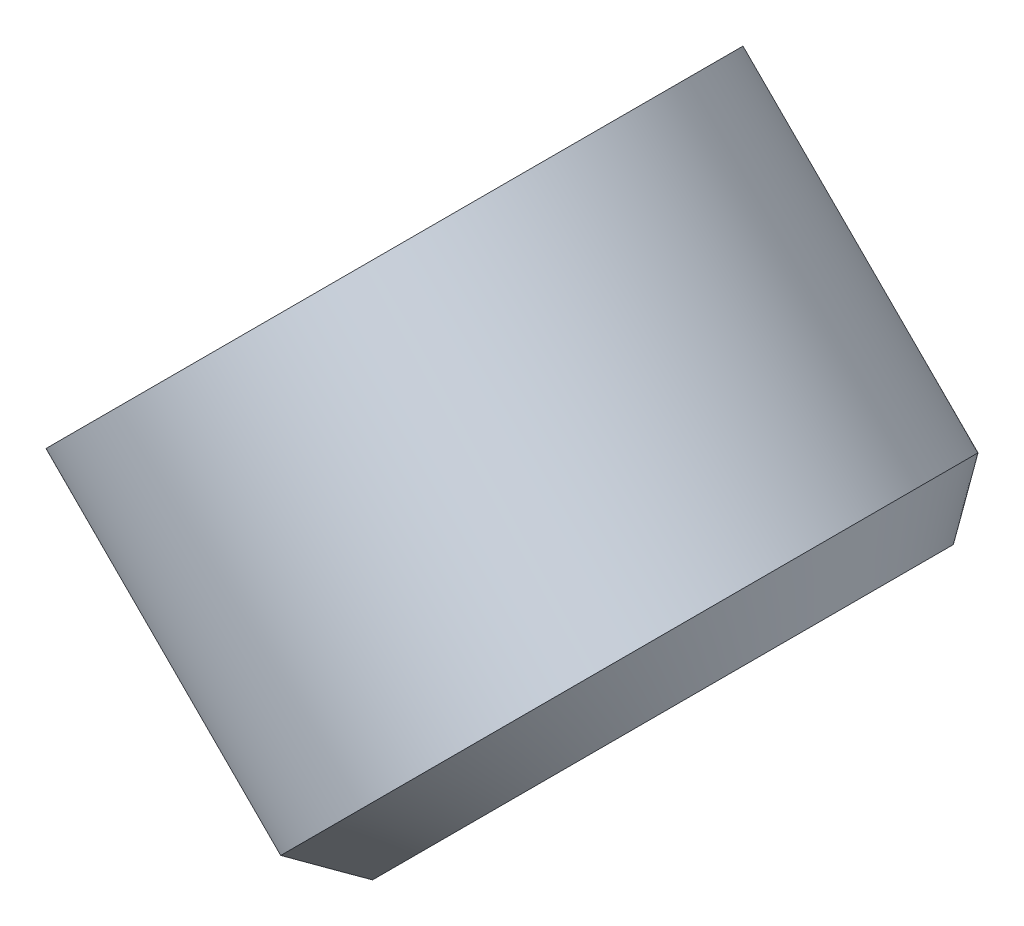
ISO-10303-21;
HEADER;
FILE_DESCRIPTION(('STEP AP214'),'2;1');
FILE_NAME('part.step','',(''),(''),'','','');
FILE_SCHEMA(('AUTOMOTIVE_DESIGN { 1 0 10303 214 1 1 1 1 }'));
ENDSEC;
DATA;
#1=APPLICATION_CONTEXT('core data for automotive mechanical design processes');
#2=APPLICATION_PROTOCOL_DEFINITION('international standard','automotive_design',2000,#1);
#3=PRODUCT_CONTEXT('',#1,'mechanical');
#4=PRODUCT('Part','Part','',(#3));
#5=PRODUCT_RELATED_PRODUCT_CATEGORY('part','',(#4));
#6=PRODUCT_DEFINITION_FORMATION('','',#4);
#7=PRODUCT_DEFINITION_CONTEXT('part definition',#1,'design');
#8=PRODUCT_DEFINITION('design','',#6,#7);
#9=PRODUCT_DEFINITION_SHAPE('','',#8);
#10=(LENGTH_UNIT() NAMED_UNIT(*) SI_UNIT(.MILLI.,.METRE.));
#11=(NAMED_UNIT(*) PLANE_ANGLE_UNIT() SI_UNIT($,.RADIAN.));
#12=(NAMED_UNIT(*) SI_UNIT($,.STERADIAN.) SOLID_ANGLE_UNIT());
#13=UNCERTAINTY_MEASURE_WITH_UNIT(LENGTH_MEASURE(1.E-05),#10,'distance_accuracy_value','');
#14=(GEOMETRIC_REPRESENTATION_CONTEXT(3) GLOBAL_UNCERTAINTY_ASSIGNED_CONTEXT((#13)) GLOBAL_UNIT_ASSIGNED_CONTEXT((#10,
#11,#12)) REPRESENTATION_CONTEXT('',''));
#15=CARTESIAN_POINT('',(0.,0.,0.));
#16=DIRECTION('',(0.,0.,1.));
#17=DIRECTION('',(1.,0.,0.));
#18=AXIS2_PLACEMENT_3D('',#15,#16,#17);
#19=CARTESIAN_POINT('',(-5.00539085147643,7.39387099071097,43.18));
#20=DIRECTION('',(-0.707106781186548,0.707106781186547,0.));
#21=DIRECTION('',(0.,0.,-1.));
#22=AXIS2_PLACEMENT_3D('',#19,#20,#21);
#23=PLANE('',#22);
#24=CARTESIAN_POINT('',(-6.1996309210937,6.19963092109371,41.656));
#25=DIRECTION('',(-0.707106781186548,0.707106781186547,0.));
#26=DIRECTION('',(-0.707106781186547,-0.707106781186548,0.));
#27=AXIS2_PLACEMENT_3D('',#24,#25,#26);
#28=CIRCLE('',#27,1.52399999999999);
#29=CARTESIAN_POINT('',(-7.27726165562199,5.12200018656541,41.656));
#30=VERTEX_POINT('',#29);
#31=EDGE_CURVE('E27',#30,#30,#28,.F.);
#32=ORIENTED_EDGE('',*,*,#31,.F.);
#33=EDGE_LOOP('',(#32));
#34=FACE_BOUND('',#33,.T.);
#35=ADVANCED_FACE('F15',(#34),#23,.T.);
#36=CARTESIAN_POINT('',(-3.8647643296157,5.66081555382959,40.386));
#37=DIRECTION('',(0.707106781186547,-0.707106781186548,0.));
#38=DIRECTION('',(0.,0.,1.));
#39=AXIS2_PLACEMENT_3D('',#36,#37,#38);
#40=PLANE('',#39);
#41=CARTESIAN_POINT('',(-4.76278994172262,4.76278994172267,41.656));
#42=DIRECTION('',(0.707106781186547,-0.707106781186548,0.));
#43=DIRECTION('',(0.707106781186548,0.707106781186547,0.));
#44=AXIS2_PLACEMENT_3D('',#41,#42,#43);
#45=CIRCLE('',#44,1.27000000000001);
#46=CARTESIAN_POINT('',(-3.86476432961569,5.66081555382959,41.656));
#47=VERTEX_POINT('',#46);
#48=EDGE_CURVE('E19',#47,#47,#45,.F.);
#49=ORIENTED_EDGE('',*,*,#48,.F.);
#50=EDGE_LOOP('',(#49));
#51=FACE_BOUND('',#50,.T.);
#52=ADVANCED_FACE('F35',(#51),#40,.T.);
#53=CARTESIAN_POINT('',(-4.40357969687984,4.40357969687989,41.656));
#54=DIRECTION('',(-0.707106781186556,0.707106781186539,0.));
#55=DIRECTION('',(-0.707106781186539,-0.707106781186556,0.));
#56=AXIS2_PLACEMENT_3D('',#53,#54,#55);
#57=CYLINDRICAL_SURFACE('',#56,1.52399999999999);
#58=ORIENTED_EDGE('',*,*,#31,.T.);
#59=EDGE_LOOP('',(#58));
#60=FACE_BOUND('',#59,.T.);
#61=CARTESIAN_POINT('',(-4.942395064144,4.94239506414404,41.656));
#62=DIRECTION('',(0.707106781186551,-0.707106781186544,0.));
#63=DIRECTION('',(0.,0.,1.));
#64=AXIS2_PLACEMENT_3D('',#61,#62,#63);
#65=CIRCLE('',#64,1.52400000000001);
#66=CARTESIAN_POINT('',(-4.942395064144,4.94239506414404,43.18));
#67=VERTEX_POINT('',#66);
#68=EDGE_CURVE('E10',#67,#67,#65,.T.);
#69=ORIENTED_EDGE('',*,*,#68,.F.);
#70=EDGE_LOOP('',(#69));
#71=FACE_BOUND('',#70,.T.);
#72=ADVANCED_FACE('F31',(#60,#71),#57,.T.);
#73=CARTESIAN_POINT('',(-5.48121043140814,5.48121043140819,41.656));
#74=DIRECTION('',(-0.707106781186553,0.707106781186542,0.));
#75=DIRECTION('',(-0.707106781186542,-0.707106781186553,0.));
#76=AXIS2_PLACEMENT_3D('',#73,#74,#75);
#77=CONICAL_SURFACE('',#76,2.286,0.785398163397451);
#78=ORIENTED_EDGE('',*,*,#68,.T.);
#79=EDGE_LOOP('',(#78));
#80=FACE_BOUND('',#79,.T.);
#81=ORIENTED_EDGE('',*,*,#48,.T.);
#82=EDGE_LOOP('',(#81));
#83=FACE_BOUND('',#82,.T.);
#84=ADVANCED_FACE('F17',(#80,#83),#77,.T.);
#85=CLOSED_SHELL('',(#35,#52,#72,#84));
#86=MANIFOLD_SOLID_BREP('B1',#85);
#87=ADVANCED_BREP_SHAPE_REPRESENTATION('',(#18,#86),#14);
#88=SHAPE_DEFINITION_REPRESENTATION(#9,#87);
ENDSEC;
END-ISO-10303-21;
